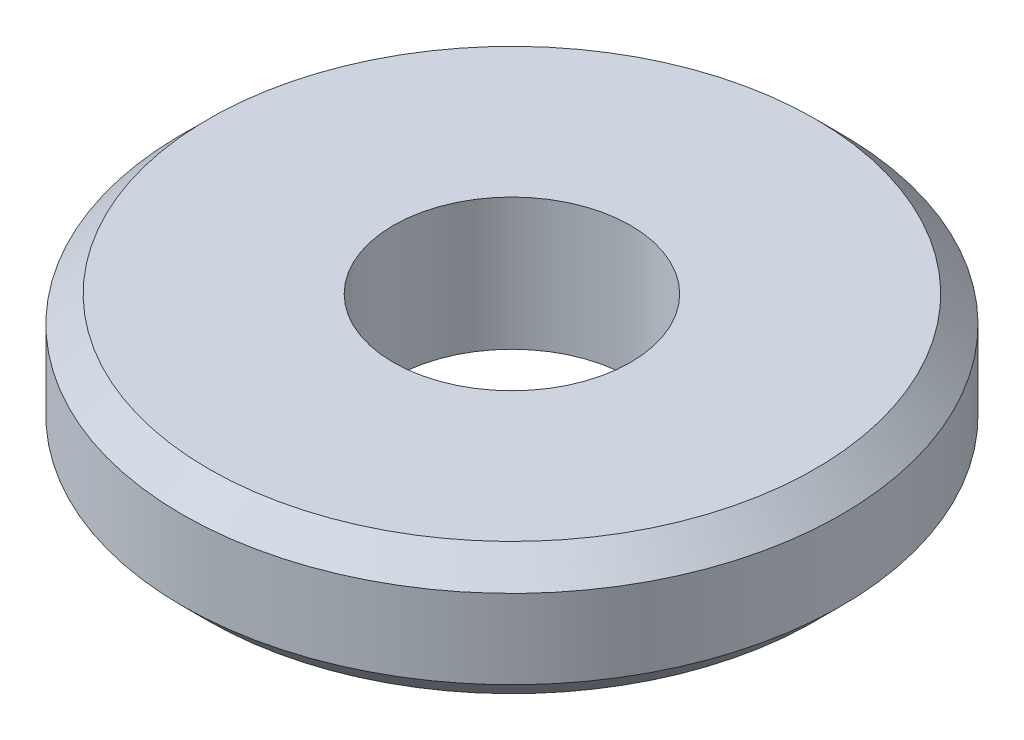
ISO-10303-21;
HEADER;
FILE_DESCRIPTION(('STEP AP214'),'2;1');
FILE_NAME('part.step','',(''),(''),'','','');
FILE_SCHEMA(('AUTOMOTIVE_DESIGN { 1 0 10303 214 1 1 1 1 }'));
ENDSEC;
DATA;
#1=APPLICATION_CONTEXT('core data for automotive mechanical design processes');
#2=APPLICATION_PROTOCOL_DEFINITION('international standard','automotive_design',2000,#1);
#3=PRODUCT_CONTEXT('',#1,'mechanical');
#4=PRODUCT('Part','Part','',(#3));
#5=PRODUCT_RELATED_PRODUCT_CATEGORY('part','',(#4));
#6=PRODUCT_DEFINITION_FORMATION('','',#4);
#7=PRODUCT_DEFINITION_CONTEXT('part definition',#1,'design');
#8=PRODUCT_DEFINITION('design','',#6,#7);
#9=PRODUCT_DEFINITION_SHAPE('','',#8);
#10=(LENGTH_UNIT() NAMED_UNIT(*) SI_UNIT(.MILLI.,.METRE.));
#11=(NAMED_UNIT(*) PLANE_ANGLE_UNIT() SI_UNIT($,.RADIAN.));
#12=(NAMED_UNIT(*) SI_UNIT($,.STERADIAN.) SOLID_ANGLE_UNIT());
#13=UNCERTAINTY_MEASURE_WITH_UNIT(LENGTH_MEASURE(1.E-05),#10,'distance_accuracy_value','');
#14=(GEOMETRIC_REPRESENTATION_CONTEXT(3) GLOBAL_UNCERTAINTY_ASSIGNED_CONTEXT((#13)) GLOBAL_UNIT_ASSIGNED_CONTEXT((#10,
#11,#12)) REPRESENTATION_CONTEXT('',''));
#15=CARTESIAN_POINT('',(0.,0.,0.));
#16=DIRECTION('',(0.,0.,1.));
#17=DIRECTION('',(1.,0.,0.));
#18=AXIS2_PLACEMENT_3D('',#15,#16,#17);
#19=CARTESIAN_POINT('',(0.,5.,0.));
#20=DIRECTION('',(0.,1.,0.));
#21=DIRECTION('',(0.,0.,1.));
#22=AXIS2_PLACEMENT_3D('',#19,#20,#21);
#23=PLANE('',#22);
#24=CARTESIAN_POINT('',(0.,5.,0.));
#25=DIRECTION('',(0.,1.,0.));
#26=DIRECTION('',(0.,0.,1.));
#27=AXIS2_PLACEMENT_3D('',#24,#25,#26);
#28=CIRCLE('',#27,11.5);
#29=CARTESIAN_POINT('',(0.,5.,11.5));
#30=VERTEX_POINT('',#29);
#31=EDGE_CURVE('E10',#30,#30,#28,.T.);
#32=ORIENTED_EDGE('',*,*,#31,.T.);
#33=EDGE_LOOP('',(#32));
#34=FACE_BOUND('',#33,.T.);
#35=CARTESIAN_POINT('',(0.,5.,0.));
#36=DIRECTION('',(0.,1.,0.));
#37=DIRECTION('',(0.,0.,1.));
#38=AXIS2_PLACEMENT_3D('',#35,#36,#37);
#39=CIRCLE('',#38,4.5);
#40=CARTESIAN_POINT('',(0.,5.,4.5));
#41=VERTEX_POINT('',#40);
#42=EDGE_CURVE('E49',#41,#41,#39,.T.);
#43=ORIENTED_EDGE('',*,*,#42,.F.);
#44=EDGE_LOOP('',(#43));
#45=FACE_BOUND('',#44,.T.);
#46=ADVANCED_FACE('F29',(#34,#45),#23,.T.);
#47=CARTESIAN_POINT('',(0.,0.,0.));
#48=DIRECTION('',(0.,1.,0.));
#49=DIRECTION('',(0.,0.,1.));
#50=AXIS2_PLACEMENT_3D('',#47,#48,#49);
#51=PLANE('',#50);
#52=CARTESIAN_POINT('',(0.,0.,0.));
#53=DIRECTION('',(0.,1.,0.));
#54=DIRECTION('',(0.,0.,1.));
#55=AXIS2_PLACEMENT_3D('',#52,#53,#54);
#56=CIRCLE('',#55,11.5);
#57=CARTESIAN_POINT('',(0.,0.,11.5));
#58=VERTEX_POINT('',#57);
#59=EDGE_CURVE('E36',#58,#58,#56,.F.);
#60=ORIENTED_EDGE('',*,*,#59,.T.);
#61=EDGE_LOOP('',(#60));
#62=FACE_BOUND('',#61,.T.);
#63=CARTESIAN_POINT('',(0.,0.,0.));
#64=DIRECTION('',(0.,1.,0.));
#65=DIRECTION('',(0.,0.,1.));
#66=AXIS2_PLACEMENT_3D('',#63,#64,#65);
#67=CIRCLE('',#66,4.5);
#68=CARTESIAN_POINT('',(0.,0.,4.5));
#69=VERTEX_POINT('',#68);
#70=EDGE_CURVE('E50',#69,#69,#67,.T.);
#71=ORIENTED_EDGE('',*,*,#70,.T.);
#72=EDGE_LOOP('',(#71));
#73=FACE_BOUND('',#72,.T.);
#74=ADVANCED_FACE('F60',(#62,#73),#51,.F.);
#75=CARTESIAN_POINT('',(0.,5.,0.));
#76=DIRECTION('',(0.,-1.,0.));
#77=DIRECTION('',(0.,0.,-1.));
#78=AXIS2_PLACEMENT_3D('',#75,#76,#77);
#79=CYLINDRICAL_SURFACE('',#78,12.5);
#80=CARTESIAN_POINT('',(0.,1.,0.));
#81=DIRECTION('',(0.,1.,0.));
#82=DIRECTION('',(0.,0.,1.));
#83=AXIS2_PLACEMENT_3D('',#80,#81,#82);
#84=CIRCLE('',#83,12.5);
#85=CARTESIAN_POINT('',(0.,1.,12.5));
#86=VERTEX_POINT('',#85);
#87=EDGE_CURVE('E40',#86,#86,#84,.T.);
#88=ORIENTED_EDGE('',*,*,#87,.T.);
#89=EDGE_LOOP('',(#88));
#90=FACE_BOUND('',#89,.T.);
#91=CARTESIAN_POINT('',(0.,4.,0.));
#92=DIRECTION('',(0.,1.,0.));
#93=DIRECTION('',(0.,0.,1.));
#94=AXIS2_PLACEMENT_3D('',#91,#92,#93);
#95=CIRCLE('',#94,12.5);
#96=CARTESIAN_POINT('',(0.,4.,12.5));
#97=VERTEX_POINT('',#96);
#98=EDGE_CURVE('E44',#97,#97,#95,.F.);
#99=ORIENTED_EDGE('',*,*,#98,.T.);
#100=EDGE_LOOP('',(#99));
#101=FACE_BOUND('',#100,.T.);
#102=ADVANCED_FACE('F65',(#90,#101),#79,.T.);
#103=CARTESIAN_POINT('',(0.,5.,0.));
#104=DIRECTION('',(0.,-1.,0.));
#105=DIRECTION('',(0.,0.,-1.));
#106=AXIS2_PLACEMENT_3D('',#103,#104,#105);
#107=CYLINDRICAL_SURFACE('',#106,4.5);
#108=ORIENTED_EDGE('',*,*,#42,.T.);
#109=EDGE_LOOP('',(#108));
#110=FACE_BOUND('',#109,.T.);
#111=ORIENTED_EDGE('',*,*,#70,.F.);
#112=EDGE_LOOP('',(#111));
#113=FACE_BOUND('',#112,.T.);
#114=ADVANCED_FACE('F56',(#110,#113),#107,.F.);
#115=CARTESIAN_POINT('',(0.,1.,0.));
#116=DIRECTION('',(0.,1.,0.));
#117=DIRECTION('',(0.,0.,1.));
#118=AXIS2_PLACEMENT_3D('',#115,#116,#117);
#119=CONICAL_SURFACE('',#118,12.5,0.78539816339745);
#120=ORIENTED_EDGE('',*,*,#59,.F.);
#121=EDGE_LOOP('',(#120));
#122=FACE_BOUND('',#121,.T.);
#123=ORIENTED_EDGE('',*,*,#87,.F.);
#124=EDGE_LOOP('',(#123));
#125=FACE_BOUND('',#124,.T.);
#126=ADVANCED_FACE('F71',(#122,#125),#119,.T.);
#127=CARTESIAN_POINT('',(0.,5.,0.));
#128=DIRECTION('',(0.,-1.,0.));
#129=DIRECTION('',(0.,0.,-1.));
#130=AXIS2_PLACEMENT_3D('',#127,#128,#129);
#131=CONICAL_SURFACE('',#130,11.5,0.785398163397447);
#132=ORIENTED_EDGE('',*,*,#98,.F.);
#133=EDGE_LOOP('',(#132));
#134=FACE_BOUND('',#133,.T.);
#135=ORIENTED_EDGE('',*,*,#31,.F.);
#136=EDGE_LOOP('',(#135));
#137=FACE_BOUND('',#136,.T.);
#138=ADVANCED_FACE('F31',(#134,#137),#131,.T.);
#139=CLOSED_SHELL('',(#46,#74,#102,#114,#126,#138));
#140=MANIFOLD_SOLID_BREP('B2',#139);
#141=ADVANCED_BREP_SHAPE_REPRESENTATION('',(#18,#140),#14);
#142=SHAPE_DEFINITION_REPRESENTATION(#9,#141);
ENDSEC;
END-ISO-10303-21;
